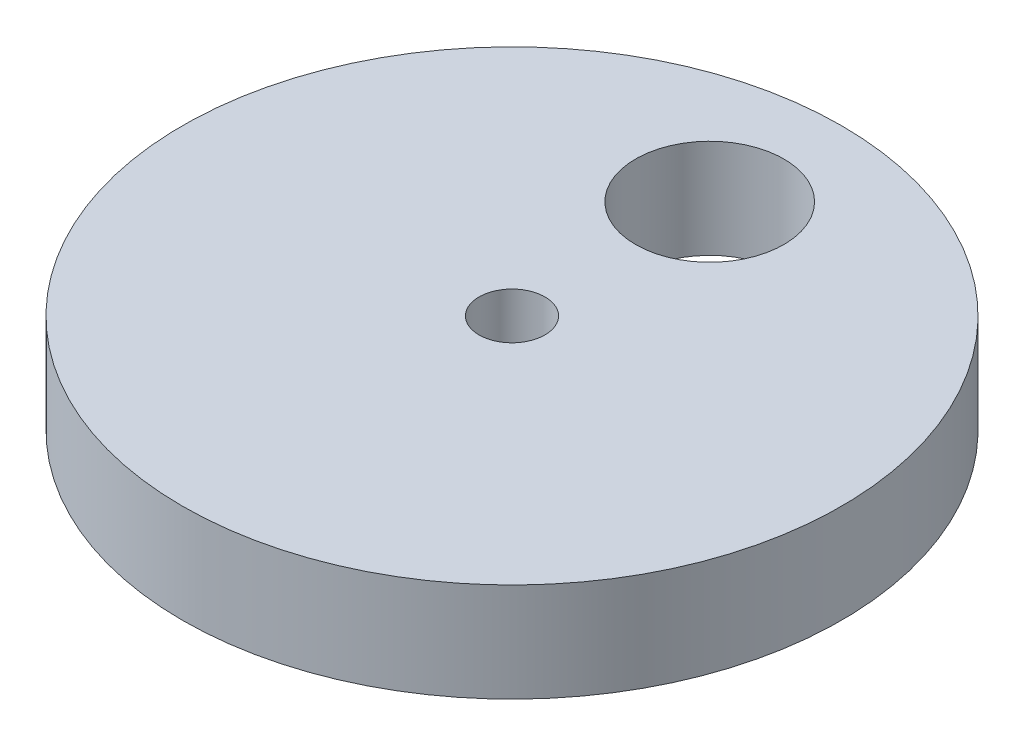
from build123d import *

# Parameters (mm, degrees)
SKETCH1_R           = 10
SKETCH1_R_2         = 1
SKETCH1_R_3         = 2.25
BOSS_EXTRUDE1_DEPTH = 3


with BuildPart() as part:
    # Sketch1 → Boss-Extrude1 (new body)
    with BuildSketch(Plane(origin=(0, 0, 0), x_dir=(1, 0, 0), z_dir=(0, 1, 0))):
        with Locations(Location((0, 0, 0), (0, 0, 270))):
            Circle(SKETCH1_R)
        with Locations(Location((0, 0, 0), (0, 0, 270))):
            Circle(SKETCH1_R_2, mode=Mode.SUBTRACT)
        with Locations(Location((0, 6, 0), (0, 0, 270))):
            Circle(SKETCH1_R_3, mode=Mode.SUBTRACT)
    extrude(amount=BOSS_EXTRUDE1_DEPTH)


solid = part.part
